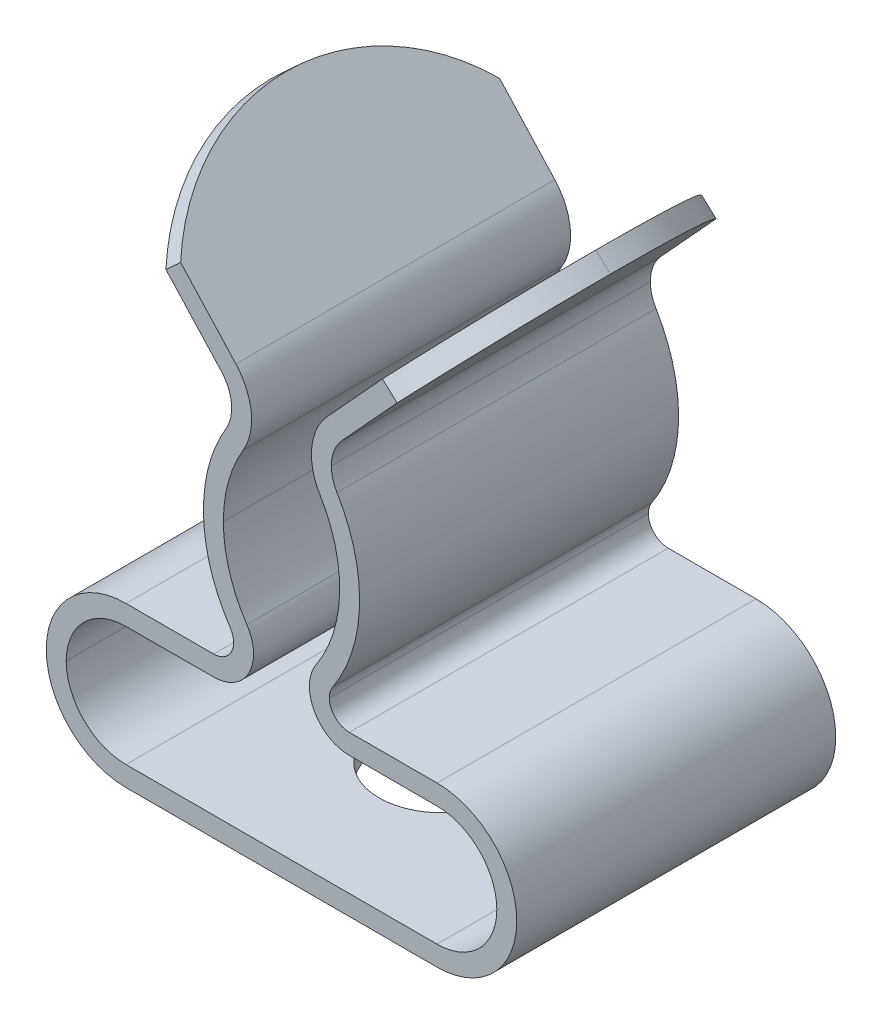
ISO-10303-21;
HEADER;
FILE_DESCRIPTION(('STEP AP214'),'2;1');
FILE_NAME('part.step','',(''),(''),'','','');
FILE_SCHEMA(('AUTOMOTIVE_DESIGN { 1 0 10303 214 1 1 1 1 }'));
ENDSEC;
DATA;
#1=APPLICATION_CONTEXT('core data for automotive mechanical design processes');
#2=APPLICATION_PROTOCOL_DEFINITION('international standard','automotive_design',2000,#1);
#3=PRODUCT_CONTEXT('',#1,'mechanical');
#4=PRODUCT('Part','Part','',(#3));
#5=PRODUCT_RELATED_PRODUCT_CATEGORY('part','',(#4));
#6=PRODUCT_DEFINITION_FORMATION('','',#4);
#7=PRODUCT_DEFINITION_CONTEXT('part definition',#1,'design');
#8=PRODUCT_DEFINITION('design','',#6,#7);
#9=PRODUCT_DEFINITION_SHAPE('','',#8);
#10=(LENGTH_UNIT() NAMED_UNIT(*) SI_UNIT(.MILLI.,.METRE.));
#11=(NAMED_UNIT(*) PLANE_ANGLE_UNIT() SI_UNIT($,.RADIAN.));
#12=(NAMED_UNIT(*) SI_UNIT($,.STERADIAN.) SOLID_ANGLE_UNIT());
#13=UNCERTAINTY_MEASURE_WITH_UNIT(LENGTH_MEASURE(1.E-05),#10,'distance_accuracy_value','');
#14=(GEOMETRIC_REPRESENTATION_CONTEXT(3) GLOBAL_UNCERTAINTY_ASSIGNED_CONTEXT((#13)) GLOBAL_UNIT_ASSIGNED_CONTEXT((#10,
#11,#12)) REPRESENTATION_CONTEXT('',''));
#15=CARTESIAN_POINT('',(0.,0.,0.));
#16=DIRECTION('',(0.,0.,1.));
#17=DIRECTION('',(1.,0.,0.));
#18=AXIS2_PLACEMENT_3D('',#15,#16,#17);
#19=CARTESIAN_POINT('',(0.,9.3,-13.5179054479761));
#20=DIRECTION('',(0.,-1.,0.));
#21=DIRECTION('',(0.,0.,-1.));
#22=AXIS2_PLACEMENT_3D('',#19,#20,#21);
#23=CYLINDRICAL_SURFACE('',#22,1.55);
#24=DIRECTION('',(0.,-1.,0.));
#25=VECTOR('',#24,1.);
#26=CARTESIAN_POINT('',(0.,9.3,-11.9679054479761));
#27=LINE('',#26,#25);
#28=CARTESIAN_POINT('',(0.,9.8,-11.9679054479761));
#29=VERTEX_POINT('',#28);
#30=CARTESIAN_POINT('',(0.,9.3,-11.9679054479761));
#31=VERTEX_POINT('',#30);
#32=EDGE_CURVE('E774',#29,#31,#27,.T.);
#33=ORIENTED_EDGE('',*,*,#32,.F.);
#34=CARTESIAN_POINT('',(0.,9.8,-13.5179054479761));
#35=DIRECTION('',(0.,1.,0.));
#36=DIRECTION('',(0.,0.,1.));
#37=AXIS2_PLACEMENT_3D('',#34,#35,#36);
#38=CIRCLE('',#37,1.55);
#39=CARTESIAN_POINT('',(0.,9.8,-15.0679054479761));
#40=VERTEX_POINT('',#39);
#41=EDGE_CURVE('E382',#29,#40,#38,.T.);
#42=ORIENTED_EDGE('',*,*,#41,.T.);
#43=DIRECTION('',(0.,-1.,0.));
#44=VECTOR('',#43,1.);
#45=CARTESIAN_POINT('',(0.,9.3,-15.0679054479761));
#46=LINE('',#45,#44);
#47=CARTESIAN_POINT('',(0.,9.3,-15.0679054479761));
#48=VERTEX_POINT('',#47);
#49=EDGE_CURVE('E791',#40,#48,#46,.T.);
#50=ORIENTED_EDGE('',*,*,#49,.T.);
#51=CARTESIAN_POINT('',(0.,9.3,-13.5179054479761));
#52=DIRECTION('',(0.,-1.,0.));
#53=DIRECTION('',(0.,0.,-1.));
#54=AXIS2_PLACEMENT_3D('',#51,#52,#53);
#55=CIRCLE('',#54,1.55);
#56=EDGE_CURVE('E19',#48,#31,#55,.T.);
#57=ORIENTED_EDGE('',*,*,#56,.T.);
#58=EDGE_LOOP('',(#33,#42,#50,#57));
#59=FACE_BOUND('',#58,.T.);
#60=ADVANCED_FACE('F16',(#59),#23,.F.);
#61=CARTESIAN_POINT('',(4.81352127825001,24.0517607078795,-13.5179054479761));
#62=DIRECTION('',(-0.737277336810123,-0.675590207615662,0.));
#63=DIRECTION('',(0.675590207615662,-0.737277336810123,0.));
#64=AXIS2_PLACEMENT_3D('',#61,#62,#63);
#65=CYLINDRICAL_SURFACE('',#64,5.);
#66=CARTESIAN_POINT('',(-0.503410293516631,19.1796905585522,-13.5179054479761));
#67=DIRECTION('',(-0.737277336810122,-0.675590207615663,0.));
#68=DIRECTION('',(-0.675590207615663,0.737277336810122,0.));
#69=AXIS2_PLACEMENT_3D('',#66,#67,#68);
#70=CIRCLE('',#69,5.);
#71=CARTESIAN_POINT('',(-2.53018091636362,21.3915225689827,-9.51790544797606));
#72=VERTEX_POINT('',#71);
#73=CARTESIAN_POINT('',(-2.53018091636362,21.3915225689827,-17.5179054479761));
#74=VERTEX_POINT('',#73);
#75=EDGE_CURVE('E526',#72,#74,#70,.T.);
#76=ORIENTED_EDGE('',*,*,#75,.T.);
#77=DIRECTION('',(-0.737277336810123,-0.675590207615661,0.));
#78=VECTOR('',#77,1.);
#79=CARTESIAN_POINT('',(2.78675065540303,26.2635927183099,-17.5179054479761));
#80=LINE('',#79,#78);
#81=CARTESIAN_POINT('',(-2.89881958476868,21.0537274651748,-17.5179054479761));
#82=VERTEX_POINT('',#81);
#83=EDGE_CURVE('E573',#74,#82,#80,.T.);
#84=ORIENTED_EDGE('',*,*,#83,.T.);
#85=CARTESIAN_POINT('',(-0.872048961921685,18.8418954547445,-13.5179054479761));
#86=DIRECTION('',(0.737277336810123,0.675590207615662,0.));
#87=DIRECTION('',(0.675590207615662,-0.737277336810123,0.));
#88=AXIS2_PLACEMENT_3D('',#85,#86,#87);
#89=CIRCLE('',#88,5.);
#90=CARTESIAN_POINT('',(-2.89881958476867,21.0537274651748,-9.51790544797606));
#91=VERTEX_POINT('',#90);
#92=EDGE_CURVE('E552',#82,#91,#89,.T.);
#93=ORIENTED_EDGE('',*,*,#92,.T.);
#94=DIRECTION('',(-0.737277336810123,-0.675590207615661,0.));
#95=VECTOR('',#94,1.);
#96=CARTESIAN_POINT('',(2.78675065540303,26.2635927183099,-9.51790544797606));
#97=LINE('',#96,#95);
#98=EDGE_CURVE('E570',#72,#91,#97,.T.);
#99=ORIENTED_EDGE('',*,*,#98,.F.);
#100=EDGE_LOOP('',(#76,#84,#93,#99));
#101=FACE_BOUND('',#100,.T.);
#102=ADVANCED_FACE('F765',(#101),#65,.T.);
#103=CARTESIAN_POINT('',(-4.81352127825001,24.0517607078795,-13.5179054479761));
#104=DIRECTION('',(0.737277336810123,-0.675590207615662,0.));
#105=DIRECTION('',(0.675590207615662,0.737277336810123,0.));
#106=AXIS2_PLACEMENT_3D('',#103,#104,#105);
#107=CYLINDRICAL_SURFACE('',#106,5.);
#108=DIRECTION('',(0.737277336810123,-0.675590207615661,0.));
#109=VECTOR('',#108,1.);
#110=CARTESIAN_POINT('',(-1.4355702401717,27.7381473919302,-13.5179054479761));
#111=LINE('',#110,#109);
#112=CARTESIAN_POINT('',(3.88136133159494,22.8660772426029,-13.5179054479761));
#113=VERTEX_POINT('',#112);
#114=CARTESIAN_POINT('',(4.25,22.5282821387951,-13.5179054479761));
#115=VERTEX_POINT('',#114);
#116=EDGE_CURVE('E660',#113,#115,#111,.T.);
#117=ORIENTED_EDGE('',*,*,#116,.F.);
#118=CARTESIAN_POINT('',(0.50341029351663,19.1796905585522,-13.5179054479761));
#119=DIRECTION('',(0.737277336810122,-0.675590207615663,0.));
#120=DIRECTION('',(-0.675590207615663,-0.737277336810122,0.));
#121=AXIS2_PLACEMENT_3D('',#118,#119,#120);
#122=CIRCLE('',#121,5.);
#123=CARTESIAN_POINT('',(2.53018091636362,21.3915225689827,-9.51790544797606));
#124=VERTEX_POINT('',#123);
#125=EDGE_CURVE('E565',#113,#124,#122,.T.);
#126=ORIENTED_EDGE('',*,*,#125,.T.);
#127=DIRECTION('',(0.737277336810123,-0.675590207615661,0.));
#128=VECTOR('',#127,1.);
#129=CARTESIAN_POINT('',(-2.78675065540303,26.2635927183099,-9.51790544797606));
#130=LINE('',#129,#128);
#131=CARTESIAN_POINT('',(2.89881958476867,21.0537274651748,-9.51790544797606));
#132=VERTEX_POINT('',#131);
#133=EDGE_CURVE('E462',#124,#132,#130,.T.);
#134=ORIENTED_EDGE('',*,*,#133,.T.);
#135=CARTESIAN_POINT('',(0.872048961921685,18.8418954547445,-13.5179054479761));
#136=DIRECTION('',(-0.737277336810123,0.675590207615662,0.));
#137=DIRECTION('',(-0.675590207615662,-0.737277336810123,0.));
#138=AXIS2_PLACEMENT_3D('',#135,#136,#137);
#139=CIRCLE('',#138,5.);
#140=EDGE_CURVE('E693',#132,#115,#139,.T.);
#141=ORIENTED_EDGE('',*,*,#140,.T.);
#142=EDGE_LOOP('',(#117,#126,#134,#141));
#143=FACE_BOUND('',#142,.T.);
#144=ADVANCED_FACE('F853',(#143),#107,.T.);
#145=CARTESIAN_POINT('',(2.25,18.8654779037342,-9.51790544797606));
#146=DIRECTION('',(0.,0.,-1.));
#147=DIRECTION('',(-1.,0.,0.));
#148=AXIS2_PLACEMENT_3D('',#145,#146,#147);
#149=CYLINDRICAL_SURFACE('',#148,1.);
#150=DIRECTION('',(0.,0.,-1.));
#151=VECTOR('',#150,1.);
#152=CARTESIAN_POINT('',(1.25,18.8654779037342,-9.51790544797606));
#153=LINE('',#152,#151);
#154=CARTESIAN_POINT('',(1.25,18.8654779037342,-9.51790544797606));
#155=VERTEX_POINT('',#154);
#156=CARTESIAN_POINT('',(1.25,18.8654779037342,-17.5179054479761));
#157=VERTEX_POINT('',#156);
#158=EDGE_CURVE('E687',#155,#157,#153,.T.);
#159=ORIENTED_EDGE('',*,*,#158,.F.);
#160=CARTESIAN_POINT('',(2.25,18.8654779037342,-9.51790544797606));
#161=DIRECTION('',(0.,0.,-1.));
#162=DIRECTION('',(-1.,0.,0.));
#163=AXIS2_PLACEMENT_3D('',#160,#161,#162);
#164=CIRCLE('',#163,1.);
#165=CARTESIAN_POINT('',(1.39166852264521,18.3523823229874,-9.51790544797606));
#166=VERTEX_POINT('',#165);
#167=EDGE_CURVE('E463',#166,#155,#164,.T.);
#168=ORIENTED_EDGE('',*,*,#167,.F.);
#169=DIRECTION('',(0.,0.,-1.));
#170=VECTOR('',#169,1.);
#171=CARTESIAN_POINT('',(1.39166852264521,18.3523823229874,-9.51790544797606));
#172=LINE('',#171,#170);
#173=CARTESIAN_POINT('',(1.39166852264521,18.3523823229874,-17.5179054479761));
#174=VERTEX_POINT('',#173);
#175=EDGE_CURVE('E11',#166,#174,#172,.T.);
#176=ORIENTED_EDGE('',*,*,#175,.T.);
#177=CARTESIAN_POINT('',(2.25,18.8654779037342,-17.5179054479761));
#178=DIRECTION('',(0.,0.,-1.));
#179=DIRECTION('',(-1.,0.,0.));
#180=AXIS2_PLACEMENT_3D('',#177,#178,#179);
#181=CIRCLE('',#180,1.);
#182=EDGE_CURVE('E532',#174,#157,#181,.T.);
#183=ORIENTED_EDGE('',*,*,#182,.T.);
#184=EDGE_LOOP('',(#159,#168,#176,#183));
#185=FACE_BOUND('',#184,.T.);
#186=ADVANCED_FACE('F838',(#185),#149,.F.);
#187=CARTESIAN_POINT('',(-2.04165738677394,16.3,-9.51790544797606));
#188=DIRECTION('',(0.,0.,-1.));
#189=DIRECTION('',(-1.,0.,0.));
#190=AXIS2_PLACEMENT_3D('',#187,#188,#189);
#191=CYLINDRICAL_SURFACE('',#190,4.);
#192=CARTESIAN_POINT('',(-2.04165738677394,16.3,-17.5179054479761));
#193=DIRECTION('',(0.,0.,1.));
#194=DIRECTION('',(1.,0.,0.));
#195=AXIS2_PLACEMENT_3D('',#192,#193,#194);
#196=CIRCLE('',#195,4.);
#197=CARTESIAN_POINT('',(1.28426029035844,14.0777777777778,-17.5179054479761));
#198=VERTEX_POINT('',#197);
#199=EDGE_CURVE('E535',#198,#174,#196,.T.);
#200=ORIENTED_EDGE('',*,*,#199,.T.);
#201=ORIENTED_EDGE('',*,*,#175,.F.);
#202=CARTESIAN_POINT('',(-2.04165738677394,16.3,-9.51790544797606));
#203=DIRECTION('',(0.,0.,1.));
#204=DIRECTION('',(1.,0.,0.));
#205=AXIS2_PLACEMENT_3D('',#202,#203,#204);
#206=CIRCLE('',#205,4.);
#207=CARTESIAN_POINT('',(1.28426029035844,14.0777777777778,-9.51790544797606));
#208=VERTEX_POINT('',#207);
#209=EDGE_CURVE('E446',#208,#166,#206,.T.);
#210=ORIENTED_EDGE('',*,*,#209,.F.);
#211=DIRECTION('',(0.,0.,-1.));
#212=VECTOR('',#211,1.);
#213=CARTESIAN_POINT('',(1.28426029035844,14.0777777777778,-9.51790544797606));
#214=LINE('',#213,#212);
#215=EDGE_CURVE('E703',#208,#198,#214,.T.);
#216=ORIENTED_EDGE('',*,*,#215,.T.);
#217=EDGE_LOOP('',(#200,#201,#210,#216));
#218=FACE_BOUND('',#217,.T.);
#219=ADVANCED_FACE('F830',(#218),#191,.T.);
#220=CARTESIAN_POINT('',(1.7,13.8,-9.51790544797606));
#221=DIRECTION('',(0.,0.,-1.));
#222=DIRECTION('',(-1.,0.,0.));
#223=AXIS2_PLACEMENT_3D('',#220,#221,#222);
#224=CYLINDRICAL_SURFACE('',#223,0.5);
#225=DIRECTION('',(0.,0.,-1.));
#226=VECTOR('',#225,1.);
#227=CARTESIAN_POINT('',(1.2,13.8,-9.51790544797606));
#228=LINE('',#227,#226);
#229=CARTESIAN_POINT('',(1.2,13.8,-9.51790544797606));
#230=VERTEX_POINT('',#229);
#231=CARTESIAN_POINT('',(1.2,13.8,-17.5179054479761));
#232=VERTEX_POINT('',#231);
#233=EDGE_CURVE('E662',#230,#232,#228,.T.);
#234=ORIENTED_EDGE('',*,*,#233,.F.);
#235=CARTESIAN_POINT('',(1.7,13.8,-9.51790544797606));
#236=DIRECTION('',(0.,0.,-1.));
#237=DIRECTION('',(-1.,0.,0.));
#238=AXIS2_PLACEMENT_3D('',#235,#236,#237);
#239=CIRCLE('',#238,0.5);
#240=CARTESIAN_POINT('',(1.7,13.3,-9.51790544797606));
#241=VERTEX_POINT('',#240);
#242=EDGE_CURVE('E439',#241,#230,#239,.T.);
#243=ORIENTED_EDGE('',*,*,#242,.F.);
#244=DIRECTION('',(0.,0.,-1.));
#245=VECTOR('',#244,1.);
#246=CARTESIAN_POINT('',(1.7,13.3,-9.51790544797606));
#247=LINE('',#246,#245);
#248=CARTESIAN_POINT('',(1.7,13.3,-17.5179054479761));
#249=VERTEX_POINT('',#248);
#250=EDGE_CURVE('E26',#241,#249,#247,.T.);
#251=ORIENTED_EDGE('',*,*,#250,.T.);
#252=CARTESIAN_POINT('',(1.7,13.8,-17.5179054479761));
#253=DIRECTION('',(0.,0.,-1.));
#254=DIRECTION('',(-1.,0.,0.));
#255=AXIS2_PLACEMENT_3D('',#252,#253,#254);
#256=CIRCLE('',#255,0.5);
#257=EDGE_CURVE('E544',#249,#232,#256,.T.);
#258=ORIENTED_EDGE('',*,*,#257,.T.);
#259=EDGE_LOOP('',(#234,#243,#251,#258));
#260=FACE_BOUND('',#259,.T.);
#261=ADVANCED_FACE('F824',(#260),#224,.F.);
#262=CARTESIAN_POINT('',(3.9,13.3,-9.51790544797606));
#263=DIRECTION('',(0.,-1.,0.));
#264=DIRECTION('',(0.,0.,-1.));
#265=AXIS2_PLACEMENT_3D('',#262,#263,#264);
#266=PLANE('',#265);
#267=DIRECTION('',(-1.,0.,0.));
#268=VECTOR('',#267,1.);
#269=CARTESIAN_POINT('',(3.9,13.3,-17.5179054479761));
#270=LINE('',#269,#268);
#271=CARTESIAN_POINT('',(3.9,13.3,-17.5179054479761));
#272=VERTEX_POINT('',#271);
#273=EDGE_CURVE('E453',#272,#249,#270,.T.);
#274=ORIENTED_EDGE('',*,*,#273,.T.);
#275=ORIENTED_EDGE('',*,*,#250,.F.);
#276=DIRECTION('',(-1.,0.,0.));
#277=VECTOR('',#276,1.);
#278=CARTESIAN_POINT('',(3.9,13.3,-9.51790544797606));
#279=LINE('',#278,#277);
#280=CARTESIAN_POINT('',(3.9,13.3,-9.51790544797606));
#281=VERTEX_POINT('',#280);
#282=EDGE_CURVE('E430',#281,#241,#279,.T.);
#283=ORIENTED_EDGE('',*,*,#282,.F.);
#284=DIRECTION('',(0.,0.,-1.));
#285=VECTOR('',#284,1.);
#286=CARTESIAN_POINT('',(3.9,13.3,-9.51790544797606));
#287=LINE('',#286,#285);
#288=EDGE_CURVE('E397',#281,#272,#287,.T.);
#289=ORIENTED_EDGE('',*,*,#288,.T.);
#290=EDGE_LOOP('',(#274,#275,#283,#289));
#291=FACE_BOUND('',#290,.T.);
#292=ADVANCED_FACE('F822',(#291),#266,.F.);
#293=CARTESIAN_POINT('',(3.9,11.3,-9.51790544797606));
#294=DIRECTION('',(0.,0.,-1.));
#295=DIRECTION('',(-1.,0.,0.));
#296=AXIS2_PLACEMENT_3D('',#293,#294,#295);
#297=CYLINDRICAL_SURFACE('',#296,2.);
#298=CARTESIAN_POINT('',(3.9,11.3,-17.5179054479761));
#299=DIRECTION('',(0.,0.,1.));
#300=DIRECTION('',(1.,0.,0.));
#301=AXIS2_PLACEMENT_3D('',#298,#299,#300);
#302=CIRCLE('',#301,2.);
#303=CARTESIAN_POINT('',(3.9,9.3,-17.5179054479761));
#304=VERTEX_POINT('',#303);
#305=EDGE_CURVE('E366',#304,#272,#302,.T.);
#306=ORIENTED_EDGE('',*,*,#305,.T.);
#307=ORIENTED_EDGE('',*,*,#288,.F.);
#308=CARTESIAN_POINT('',(3.9,11.3,-9.51790544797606));
#309=DIRECTION('',(0.,0.,1.));
#310=DIRECTION('',(1.,0.,0.));
#311=AXIS2_PLACEMENT_3D('',#308,#309,#310);
#312=CIRCLE('',#311,2.);
#313=CARTESIAN_POINT('',(3.9,9.3,-9.51790544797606));
#314=VERTEX_POINT('',#313);
#315=EDGE_CURVE('E426',#314,#281,#312,.T.);
#316=ORIENTED_EDGE('',*,*,#315,.F.);
#317=DIRECTION('',(0.,0.,-1.));
#318=VECTOR('',#317,1.);
#319=CARTESIAN_POINT('',(3.9,9.3,-9.51790544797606));
#320=LINE('',#319,#318);
#321=EDGE_CURVE('E343',#314,#304,#320,.T.);
#322=ORIENTED_EDGE('',*,*,#321,.T.);
#323=EDGE_LOOP('',(#306,#307,#316,#322));
#324=FACE_BOUND('',#323,.T.);
#325=ADVANCED_FACE('F821',(#324),#297,.T.);
#326=CARTESIAN_POINT('',(3.9,9.3,-9.51790544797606));
#327=DIRECTION('',(0.,1.,0.));
#328=DIRECTION('',(0.,0.,-1.));
#329=AXIS2_PLACEMENT_3D('',#326,#327,#328);
#330=PLANE('',#329);
#331=ORIENTED_EDGE('',*,*,#56,.F.);
#332=CARTESIAN_POINT('',(0.,9.3,-13.5179054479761));
#333=DIRECTION('',(0.,-1.,0.));
#334=DIRECTION('',(0.,0.,-1.));
#335=AXIS2_PLACEMENT_3D('',#332,#333,#334);
#336=CIRCLE('',#335,1.55);
#337=EDGE_CURVE('E777',#31,#48,#336,.T.);
#338=ORIENTED_EDGE('',*,*,#337,.F.);
#339=EDGE_LOOP('',(#331,#338));
#340=FACE_BOUND('',#339,.T.);
#341=DIRECTION('',(1.,0.,0.));
#342=VECTOR('',#341,1.);
#343=CARTESIAN_POINT('',(3.9,9.3,-17.5179054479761));
#344=LINE('',#343,#342);
#345=CARTESIAN_POINT('',(-3.9,9.3,-17.5179054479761));
#346=VERTEX_POINT('',#345);
#347=EDGE_CURVE('E360',#346,#304,#344,.T.);
#348=ORIENTED_EDGE('',*,*,#347,.T.);
#349=ORIENTED_EDGE('',*,*,#321,.F.);
#350=DIRECTION('',(1.,0.,0.));
#351=VECTOR('',#350,1.);
#352=CARTESIAN_POINT('',(3.9,9.3,-9.51790544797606));
#353=LINE('',#352,#351);
#354=CARTESIAN_POINT('',(-3.9,9.3,-9.51790544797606));
#355=VERTEX_POINT('',#354);
#356=EDGE_CURVE('E431',#355,#314,#353,.T.);
#357=ORIENTED_EDGE('',*,*,#356,.F.);
#358=DIRECTION('',(0.,0.,-1.));
#359=VECTOR('',#358,1.);
#360=CARTESIAN_POINT('',(-3.9,9.3,-9.51790544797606));
#361=LINE('',#360,#359);
#362=EDGE_CURVE('E719',#355,#346,#361,.T.);
#363=ORIENTED_EDGE('',*,*,#362,.T.);
#364=EDGE_LOOP('',(#348,#349,#357,#363));
#365=FACE_BOUND('',#364,.T.);
#366=ADVANCED_FACE('F819',(#340,#365),#330,.F.);
#367=CARTESIAN_POINT('',(-3.9,11.3,-9.51790544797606));
#368=DIRECTION('',(0.,0.,-1.));
#369=DIRECTION('',(-1.,0.,0.));
#370=AXIS2_PLACEMENT_3D('',#367,#368,#369);
#371=CYLINDRICAL_SURFACE('',#370,2.);
#372=DIRECTION('',(0.,0.,-1.));
#373=VECTOR('',#372,1.);
#374=CARTESIAN_POINT('',(-5.9,11.3,-9.51790544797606));
#375=LINE('',#374,#373);
#376=CARTESIAN_POINT('',(-5.9,11.3,-9.51790544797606));
#377=VERTEX_POINT('',#376);
#378=CARTESIAN_POINT('',(-5.9,11.3,-17.5179054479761));
#379=VERTEX_POINT('',#378);
#380=EDGE_CURVE('E714',#377,#379,#375,.T.);
#381=ORIENTED_EDGE('',*,*,#380,.F.);
#382=CARTESIAN_POINT('',(-3.9,11.3,-9.51790544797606));
#383=DIRECTION('',(0.,0.,1.));
#384=DIRECTION('',(-1.,0.,0.));
#385=AXIS2_PLACEMENT_3D('',#382,#383,#384);
#386=CIRCLE('',#385,2.);
#387=CARTESIAN_POINT('',(-3.9,13.3,-9.51790544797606));
#388=VERTEX_POINT('',#387);
#389=EDGE_CURVE('E338',#388,#377,#386,.T.);
#390=ORIENTED_EDGE('',*,*,#389,.F.);
#391=DIRECTION('',(0.,0.,-1.));
#392=VECTOR('',#391,1.);
#393=CARTESIAN_POINT('',(-3.9,13.3,-9.51790544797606));
#394=LINE('',#393,#392);
#395=CARTESIAN_POINT('',(-3.9,13.3,-17.5179054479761));
#396=VERTEX_POINT('',#395);
#397=EDGE_CURVE('E331',#388,#396,#394,.T.);
#398=ORIENTED_EDGE('',*,*,#397,.T.);
#399=CARTESIAN_POINT('',(-3.9,11.3,-17.5179054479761));
#400=DIRECTION('',(0.,0.,1.));
#401=DIRECTION('',(-1.,0.,0.));
#402=AXIS2_PLACEMENT_3D('',#399,#400,#401);
#403=CIRCLE('',#402,2.);
#404=EDGE_CURVE('E336',#396,#379,#403,.T.);
#405=ORIENTED_EDGE('',*,*,#404,.T.);
#406=EDGE_LOOP('',(#381,#390,#398,#405));
#407=FACE_BOUND('',#406,.T.);
#408=ADVANCED_FACE('F334',(#407),#371,.T.);
#409=CARTESIAN_POINT('',(-3.9,13.3,-9.51790544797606));
#410=DIRECTION('',(0.,-1.,0.));
#411=DIRECTION('',(-1.,0.,0.));
#412=AXIS2_PLACEMENT_3D('',#409,#410,#411);
#413=PLANE('',#412);
#414=DIRECTION('',(-1.,0.,0.));
#415=VECTOR('',#414,1.);
#416=CARTESIAN_POINT('',(-3.9,13.3,-17.5179054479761));
#417=LINE('',#416,#415);
#418=CARTESIAN_POINT('',(-1.7,13.3,-17.5179054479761));
#419=VERTEX_POINT('',#418);
#420=EDGE_CURVE('E347',#419,#396,#417,.T.);
#421=ORIENTED_EDGE('',*,*,#420,.T.);
#422=ORIENTED_EDGE('',*,*,#397,.F.);
#423=DIRECTION('',(-1.,0.,0.));
#424=VECTOR('',#423,1.);
#425=CARTESIAN_POINT('',(-3.9,13.3,-9.51790544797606));
#426=LINE('',#425,#424);
#427=CARTESIAN_POINT('',(-1.7,13.3,-9.51790544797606));
#428=VERTEX_POINT('',#427);
#429=EDGE_CURVE('E582',#428,#388,#426,.T.);
#430=ORIENTED_EDGE('',*,*,#429,.F.);
#431=DIRECTION('',(0.,0.,-1.));
#432=VECTOR('',#431,1.);
#433=CARTESIAN_POINT('',(-1.7,13.3,-9.51790544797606));
#434=LINE('',#433,#432);
#435=EDGE_CURVE('E344',#428,#419,#434,.T.);
#436=ORIENTED_EDGE('',*,*,#435,.T.);
#437=EDGE_LOOP('',(#421,#422,#430,#436));
#438=FACE_BOUND('',#437,.T.);
#439=ADVANCED_FACE('F348',(#438),#413,.F.);
#440=CARTESIAN_POINT('',(-1.7,13.8,-9.51790544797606));
#441=DIRECTION('',(0.,0.,-1.));
#442=DIRECTION('',(-1.,0.,0.));
#443=AXIS2_PLACEMENT_3D('',#440,#441,#442);
#444=CYLINDRICAL_SURFACE('',#443,0.5);
#445=CARTESIAN_POINT('',(-1.7,13.8,-17.5179054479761));
#446=DIRECTION('',(0.,0.,-1.));
#447=DIRECTION('',(1.,0.,0.));
#448=AXIS2_PLACEMENT_3D('',#445,#446,#447);
#449=CIRCLE('',#448,0.5);
#450=CARTESIAN_POINT('',(-1.28426029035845,14.0777777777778,-17.5179054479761));
#451=VERTEX_POINT('',#450);
#452=EDGE_CURVE('E352',#451,#419,#449,.T.);
#453=ORIENTED_EDGE('',*,*,#452,.T.);
#454=ORIENTED_EDGE('',*,*,#435,.F.);
#455=CARTESIAN_POINT('',(-1.7,13.8,-9.51790544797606));
#456=DIRECTION('',(0.,0.,-1.));
#457=DIRECTION('',(1.,0.,0.));
#458=AXIS2_PLACEMENT_3D('',#455,#456,#457);
#459=CIRCLE('',#458,0.5);
#460=CARTESIAN_POINT('',(-1.28426029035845,14.0777777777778,-9.51790544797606));
#461=VERTEX_POINT('',#460);
#462=EDGE_CURVE('E585',#461,#428,#459,.T.);
#463=ORIENTED_EDGE('',*,*,#462,.F.);
#464=DIRECTION('',(0.,0.,-1.));
#465=VECTOR('',#464,1.);
#466=CARTESIAN_POINT('',(-1.28426029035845,14.0777777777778,-9.51790544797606));
#467=LINE('',#466,#465);
#468=EDGE_CURVE('E418',#461,#451,#467,.T.);
#469=ORIENTED_EDGE('',*,*,#468,.T.);
#470=EDGE_LOOP('',(#453,#454,#463,#469));
#471=FACE_BOUND('',#470,.T.);
#472=ADVANCED_FACE('F735',(#471),#444,.F.);
#473=CARTESIAN_POINT('',(2.04165738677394,16.3,-9.51790544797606));
#474=DIRECTION('',(0.,0.,-1.));
#475=DIRECTION('',(-1.,0.,0.));
#476=AXIS2_PLACEMENT_3D('',#473,#474,#475);
#477=CYLINDRICAL_SURFACE('',#476,4.);
#478=DIRECTION('',(0.,0.,-1.));
#479=VECTOR('',#478,1.);
#480=CARTESIAN_POINT('',(-1.95834261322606,16.3,-9.51790544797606));
#481=LINE('',#480,#479);
#482=CARTESIAN_POINT('',(-1.95834261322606,16.3,-9.51790544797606));
#483=VERTEX_POINT('',#482);
#484=CARTESIAN_POINT('',(-1.95834261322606,16.3,-17.5179054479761));
#485=VERTEX_POINT('',#484);
#486=EDGE_CURVE('E727',#483,#485,#481,.T.);
#487=ORIENTED_EDGE('',*,*,#486,.F.);
#488=CARTESIAN_POINT('',(2.04165738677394,16.3,-9.51790544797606));
#489=DIRECTION('',(0.,0.,1.));
#490=DIRECTION('',(-1.,0.,0.));
#491=AXIS2_PLACEMENT_3D('',#488,#489,#490);
#492=CIRCLE('',#491,4.);
#493=CARTESIAN_POINT('',(-1.39166852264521,18.3523823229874,-9.51790544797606));
#494=VERTEX_POINT('',#493);
#495=EDGE_CURVE('E580',#494,#483,#492,.T.);
#496=ORIENTED_EDGE('',*,*,#495,.F.);
#497=DIRECTION('',(0.,0.,-1.));
#498=VECTOR('',#497,1.);
#499=CARTESIAN_POINT('',(-1.39166852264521,18.3523823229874,-9.51790544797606));
#500=LINE('',#499,#498);
#501=CARTESIAN_POINT('',(-1.39166852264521,18.3523823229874,-17.5179054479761));
#502=VERTEX_POINT('',#501);
#503=EDGE_CURVE('E39',#494,#502,#500,.T.);
#504=ORIENTED_EDGE('',*,*,#503,.T.);
#505=CARTESIAN_POINT('',(2.04165738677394,16.3,-17.5179054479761));
#506=DIRECTION('',(0.,0.,1.));
#507=DIRECTION('',(-1.,0.,0.));
#508=AXIS2_PLACEMENT_3D('',#505,#506,#507);
#509=CIRCLE('',#508,4.);
#510=EDGE_CURVE('E370',#502,#485,#509,.T.);
#511=ORIENTED_EDGE('',*,*,#510,.T.);
#512=EDGE_LOOP('',(#487,#496,#504,#511));
#513=FACE_BOUND('',#512,.T.);
#514=ADVANCED_FACE('F744',(#513),#477,.T.);
#515=CARTESIAN_POINT('',(-2.25,18.8654779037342,-9.51790544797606));
#516=DIRECTION('',(0.,0.,-1.));
#517=DIRECTION('',(-1.,0.,0.));
#518=AXIS2_PLACEMENT_3D('',#515,#516,#517);
#519=CYLINDRICAL_SURFACE('',#518,1.);
#520=CARTESIAN_POINT('',(-2.25,18.8654779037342,-17.5179054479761));
#521=DIRECTION('',(0.,0.,-1.));
#522=DIRECTION('',(1.,0.,0.));
#523=AXIS2_PLACEMENT_3D('',#520,#521,#522);
#524=CIRCLE('',#523,1.);
#525=CARTESIAN_POINT('',(-1.51272266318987,19.5410681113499,-17.5179054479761));
#526=VERTEX_POINT('',#525);
#527=EDGE_CURVE('E372',#526,#502,#524,.T.);
#528=ORIENTED_EDGE('',*,*,#527,.T.);
#529=ORIENTED_EDGE('',*,*,#503,.F.);
#530=CARTESIAN_POINT('',(-2.25,18.8654779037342,-9.51790544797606));
#531=DIRECTION('',(0.,0.,-1.));
#532=DIRECTION('',(1.,0.,0.));
#533=AXIS2_PLACEMENT_3D('',#530,#531,#532);
#534=CIRCLE('',#533,1.);
#535=CARTESIAN_POINT('',(-1.51272266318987,19.5410681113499,-9.51790544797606));
#536=VERTEX_POINT('',#535);
#537=EDGE_CURVE('E577',#536,#494,#534,.T.);
#538=ORIENTED_EDGE('',*,*,#537,.F.);
#539=DIRECTION('',(0.,0.,-1.));
#540=VECTOR('',#539,1.);
#541=CARTESIAN_POINT('',(-1.51272266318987,19.5410681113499,-9.51790544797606));
#542=LINE('',#541,#540);
#543=EDGE_CURVE('E560',#536,#526,#542,.T.);
#544=ORIENTED_EDGE('',*,*,#543,.T.);
#545=EDGE_LOOP('',(#528,#529,#538,#544));
#546=FACE_BOUND('',#545,.T.);
#547=ADVANCED_FACE('F751',(#546),#519,.F.);
#548=CARTESIAN_POINT('',(-2.25,18.8654779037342,-9.51790544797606));
#549=DIRECTION('',(0.,0.,-1.));
#550=DIRECTION('',(-1.,0.,0.));
#551=AXIS2_PLACEMENT_3D('',#548,#549,#550);
#552=CYLINDRICAL_SURFACE('',#551,1.5);
#553=CARTESIAN_POINT('',(-2.25,18.8654779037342,-17.5179054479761));
#554=DIRECTION('',(0.,0.,-1.));
#555=DIRECTION('',(1.,0.,0.));
#556=AXIS2_PLACEMENT_3D('',#553,#554,#555);
#557=CIRCLE('',#556,1.5);
#558=CARTESIAN_POINT('',(-1.14408399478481,19.8788632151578,-17.5179054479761));
#559=VERTEX_POINT('',#558);
#560=CARTESIAN_POINT('',(-0.962502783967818,18.095834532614,-17.5179054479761));
#561=VERTEX_POINT('',#560);
#562=EDGE_CURVE('E576',#559,#561,#557,.T.);
#563=ORIENTED_EDGE('',*,*,#562,.F.);
#564=DIRECTION('',(0.,0.,-1.));
#565=VECTOR('',#564,1.);
#566=CARTESIAN_POINT('',(-1.14408399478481,19.8788632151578,-9.51790544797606));
#567=LINE('',#566,#565);
#568=CARTESIAN_POINT('',(-1.14408399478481,19.8788632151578,-9.51790544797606));
#569=VERTEX_POINT('',#568);
#570=EDGE_CURVE('E531',#569,#559,#567,.T.);
#571=ORIENTED_EDGE('',*,*,#570,.F.);
#572=CARTESIAN_POINT('',(-2.25,18.8654779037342,-9.51790544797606));
#573=DIRECTION('',(0.,0.,-1.));
#574=DIRECTION('',(1.,0.,0.));
#575=AXIS2_PLACEMENT_3D('',#572,#573,#574);
#576=CIRCLE('',#575,1.5);
#577=CARTESIAN_POINT('',(-0.962502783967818,18.095834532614,-9.51790544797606));
#578=VERTEX_POINT('',#577);
#579=EDGE_CURVE('E620',#569,#578,#576,.T.);
#580=ORIENTED_EDGE('',*,*,#579,.T.);
#581=DIRECTION('',(0.,0.,-1.));
#582=VECTOR('',#581,1.);
#583=CARTESIAN_POINT('',(-0.962502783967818,18.095834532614,-9.51790544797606));
#584=LINE('',#583,#582);
#585=EDGE_CURVE('E443',#578,#561,#584,.T.);
#586=ORIENTED_EDGE('',*,*,#585,.T.);
#587=EDGE_LOOP('',(#563,#571,#580,#586));
#588=FACE_BOUND('',#587,.T.);
#589=ADVANCED_FACE('F916',(#588),#552,.T.);
#590=CARTESIAN_POINT('',(2.04165738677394,16.3,-9.51790544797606));
#591=DIRECTION('',(0.,0.,-1.));
#592=DIRECTION('',(-1.,0.,0.));
#593=AXIS2_PLACEMENT_3D('',#590,#591,#592);
#594=CYLINDRICAL_SURFACE('',#593,3.5);
#595=DIRECTION('',(0.,0.,-1.));
#596=VECTOR('',#595,1.);
#597=CARTESIAN_POINT('',(-1.45834261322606,16.3,-9.51790544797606));
#598=LINE('',#597,#596);
#599=CARTESIAN_POINT('',(-1.45834261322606,16.3,-9.51790544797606));
#600=VERTEX_POINT('',#599);
#601=CARTESIAN_POINT('',(-1.45834261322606,16.3,-17.5179054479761));
#602=VERTEX_POINT('',#601);
#603=EDGE_CURVE('E425',#600,#602,#598,.T.);
#604=ORIENTED_EDGE('',*,*,#603,.F.);
#605=CARTESIAN_POINT('',(2.04165738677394,16.3,-9.51790544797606));
#606=DIRECTION('',(0.,0.,1.));
#607=DIRECTION('',(1.,0.,0.));
#608=AXIS2_PLACEMENT_3D('',#605,#606,#607);
#609=CIRCLE('',#608,3.5);
#610=CARTESIAN_POINT('',(-0.868520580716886,14.3555555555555,-9.51790544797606));
#611=VERTEX_POINT('',#610);
#612=EDGE_CURVE('E616',#600,#611,#609,.T.);
#613=ORIENTED_EDGE('',*,*,#612,.T.);
#614=DIRECTION('',(0.,0.,-1.));
#615=VECTOR('',#614,1.);
#616=CARTESIAN_POINT('',(-0.868520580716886,14.3555555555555,-9.51790544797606));
#617=LINE('',#616,#615);
#618=CARTESIAN_POINT('',(-0.868520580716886,14.3555555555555,-17.5179054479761));
#619=VERTEX_POINT('',#618);
#620=EDGE_CURVE('E387',#611,#619,#617,.T.);
#621=ORIENTED_EDGE('',*,*,#620,.T.);
#622=CARTESIAN_POINT('',(2.04165738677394,16.3,-17.5179054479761));
#623=DIRECTION('',(0.,0.,1.));
#624=DIRECTION('',(1.,0.,0.));
#625=AXIS2_PLACEMENT_3D('',#622,#623,#624);
#626=CIRCLE('',#625,3.5);
#627=EDGE_CURVE('E500',#602,#619,#626,.T.);
#628=ORIENTED_EDGE('',*,*,#627,.F.);
#629=EDGE_LOOP('',(#604,#613,#621,#628));
#630=FACE_BOUND('',#629,.T.);
#631=ADVANCED_FACE('F910',(#630),#594,.F.);
#632=CARTESIAN_POINT('',(-1.7,13.8,-9.51790544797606));
#633=DIRECTION('',(0.,0.,-1.));
#634=DIRECTION('',(-1.,0.,0.));
#635=AXIS2_PLACEMENT_3D('',#632,#633,#634);
#636=CYLINDRICAL_SURFACE('',#635,1.);
#637=CARTESIAN_POINT('',(-1.7,13.8,-17.5179054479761));
#638=DIRECTION('',(0.,0.,-1.));
#639=DIRECTION('',(1.,0.,0.));
#640=AXIS2_PLACEMENT_3D('',#637,#638,#639);
#641=CIRCLE('',#640,1.);
#642=CARTESIAN_POINT('',(-1.7,12.8,-17.5179054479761));
#643=VERTEX_POINT('',#642);
#644=EDGE_CURVE('E495',#619,#643,#641,.T.);
#645=ORIENTED_EDGE('',*,*,#644,.F.);
#646=ORIENTED_EDGE('',*,*,#620,.F.);
#647=CARTESIAN_POINT('',(-1.7,13.8,-9.51790544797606));
#648=DIRECTION('',(0.,0.,-1.));
#649=DIRECTION('',(1.,0.,0.));
#650=AXIS2_PLACEMENT_3D('',#647,#648,#649);
#651=CIRCLE('',#650,1.);
#652=CARTESIAN_POINT('',(-1.7,12.8,-9.51790544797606));
#653=VERTEX_POINT('',#652);
#654=EDGE_CURVE('E612',#611,#653,#651,.T.);
#655=ORIENTED_EDGE('',*,*,#654,.T.);
#656=DIRECTION('',(0.,0.,-1.));
#657=VECTOR('',#656,1.);
#658=CARTESIAN_POINT('',(-1.7,12.8,-9.51790544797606));
#659=LINE('',#658,#657);
#660=EDGE_CURVE('E384',#653,#643,#659,.T.);
#661=ORIENTED_EDGE('',*,*,#660,.T.);
#662=EDGE_LOOP('',(#645,#646,#655,#661));
#663=FACE_BOUND('',#662,.T.);
#664=ADVANCED_FACE('F908',(#663),#636,.T.);
#665=CARTESIAN_POINT('',(-3.9,12.8,-9.51790544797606));
#666=DIRECTION('',(0.,-1.,0.));
#667=DIRECTION('',(-1.,0.,0.));
#668=AXIS2_PLACEMENT_3D('',#665,#666,#667);
#669=PLANE('',#668);
#670=DIRECTION('',(-1.,0.,0.));
#671=VECTOR('',#670,1.);
#672=CARTESIAN_POINT('',(-3.9,12.8,-17.5179054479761));
#673=LINE('',#672,#671);
#674=CARTESIAN_POINT('',(-3.9,12.8,-17.5179054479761));
#675=VERTEX_POINT('',#674);
#676=EDGE_CURVE('E499',#643,#675,#673,.T.);
#677=ORIENTED_EDGE('',*,*,#676,.F.);
#678=ORIENTED_EDGE('',*,*,#660,.F.);
#679=DIRECTION('',(-1.,0.,0.));
#680=VECTOR('',#679,1.);
#681=CARTESIAN_POINT('',(-3.9,12.8,-9.51790544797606));
#682=LINE('',#681,#680);
#683=CARTESIAN_POINT('',(-3.9,12.8,-9.51790544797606));
#684=VERTEX_POINT('',#683);
#685=EDGE_CURVE('E609',#653,#684,#682,.T.);
#686=ORIENTED_EDGE('',*,*,#685,.T.);
#687=DIRECTION('',(0.,0.,-1.));
#688=VECTOR('',#687,1.);
#689=CARTESIAN_POINT('',(-3.9,12.8,-9.51790544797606));
#690=LINE('',#689,#688);
#691=EDGE_CURVE('E473',#684,#675,#690,.T.);
#692=ORIENTED_EDGE('',*,*,#691,.T.);
#693=EDGE_LOOP('',(#677,#678,#686,#692));
#694=FACE_BOUND('',#693,.T.);
#695=ADVANCED_FACE('F902',(#694),#669,.T.);
#696=CARTESIAN_POINT('',(-3.9,11.3,-9.51790544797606));
#697=DIRECTION('',(0.,0.,-1.));
#698=DIRECTION('',(-1.,0.,0.));
#699=AXIS2_PLACEMENT_3D('',#696,#697,#698);
#700=CYLINDRICAL_SURFACE('',#699,1.5);
#701=DIRECTION('',(0.,0.,-1.));
#702=VECTOR('',#701,1.);
#703=CARTESIAN_POINT('',(-5.4,11.3,-9.51790544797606));
#704=LINE('',#703,#702);
#705=CARTESIAN_POINT('',(-5.4,11.3,-9.51790544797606));
#706=VERTEX_POINT('',#705);
#707=CARTESIAN_POINT('',(-5.4,11.3,-17.5179054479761));
#708=VERTEX_POINT('',#707);
#709=EDGE_CURVE('E457',#706,#708,#704,.T.);
#710=ORIENTED_EDGE('',*,*,#709,.F.);
#711=CARTESIAN_POINT('',(-3.9,11.3,-9.51790544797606));
#712=DIRECTION('',(0.,0.,1.));
#713=DIRECTION('',(1.,0.,0.));
#714=AXIS2_PLACEMENT_3D('',#711,#712,#713);
#715=CIRCLE('',#714,1.5);
#716=CARTESIAN_POINT('',(-3.9,9.8,-9.51790544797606));
#717=VERTEX_POINT('',#716);
#718=EDGE_CURVE('E605',#706,#717,#715,.T.);
#719=ORIENTED_EDGE('',*,*,#718,.T.);
#720=DIRECTION('',(0.,0.,-1.));
#721=VECTOR('',#720,1.);
#722=CARTESIAN_POINT('',(-3.9,9.8,-9.51790544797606));
#723=LINE('',#722,#721);
#724=CARTESIAN_POINT('',(-3.9,9.8,-17.5179054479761));
#725=VERTEX_POINT('',#724);
#726=EDGE_CURVE('E379',#717,#725,#723,.T.);
#727=ORIENTED_EDGE('',*,*,#726,.T.);
#728=CARTESIAN_POINT('',(-3.9,11.3,-17.5179054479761));
#729=DIRECTION('',(0.,0.,1.));
#730=DIRECTION('',(1.,0.,0.));
#731=AXIS2_PLACEMENT_3D('',#728,#729,#730);
#732=CIRCLE('',#731,1.5);
#733=EDGE_CURVE('E601',#708,#725,#732,.T.);
#734=ORIENTED_EDGE('',*,*,#733,.F.);
#735=EDGE_LOOP('',(#710,#719,#727,#734));
#736=FACE_BOUND('',#735,.T.);
#737=ADVANCED_FACE('F895',(#736),#700,.F.);
#738=CARTESIAN_POINT('',(3.9,9.8,-9.51790544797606));
#739=DIRECTION('',(0.,1.,0.));
#740=DIRECTION('',(0.,0.,-1.));
#741=AXIS2_PLACEMENT_3D('',#738,#739,#740);
#742=PLANE('',#741);
#743=CARTESIAN_POINT('',(0.,9.8,-13.5179054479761));
#744=DIRECTION('',(0.,1.,0.));
#745=DIRECTION('',(0.,0.,1.));
#746=AXIS2_PLACEMENT_3D('',#743,#744,#745);
#747=CIRCLE('',#746,1.55);
#748=EDGE_CURVE('E773',#40,#29,#747,.T.);
#749=ORIENTED_EDGE('',*,*,#748,.F.);
#750=ORIENTED_EDGE('',*,*,#41,.F.);
#751=EDGE_LOOP('',(#749,#750));
#752=FACE_BOUND('',#751,.T.);
#753=DIRECTION('',(1.,0.,0.));
#754=VECTOR('',#753,1.);
#755=CARTESIAN_POINT('',(3.9,9.8,-17.5179054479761));
#756=LINE('',#755,#754);
#757=CARTESIAN_POINT('',(3.9,9.8,-17.5179054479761));
#758=VERTEX_POINT('',#757);
#759=EDGE_CURVE('E629',#725,#758,#756,.T.);
#760=ORIENTED_EDGE('',*,*,#759,.F.);
#761=ORIENTED_EDGE('',*,*,#726,.F.);
#762=DIRECTION('',(1.,0.,0.));
#763=VECTOR('',#762,1.);
#764=CARTESIAN_POINT('',(3.9,9.8,-9.51790544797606));
#765=LINE('',#764,#763);
#766=CARTESIAN_POINT('',(3.9,9.8,-9.51790544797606));
#767=VERTEX_POINT('',#766);
#768=EDGE_CURVE('E504',#717,#767,#765,.T.);
#769=ORIENTED_EDGE('',*,*,#768,.T.);
#770=DIRECTION('',(0.,0.,-1.));
#771=VECTOR('',#770,1.);
#772=CARTESIAN_POINT('',(3.9,9.8,-9.51790544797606));
#773=LINE('',#772,#771);
#774=EDGE_CURVE('E383',#767,#758,#773,.T.);
#775=ORIENTED_EDGE('',*,*,#774,.T.);
#776=EDGE_LOOP('',(#760,#761,#769,#775));
#777=FACE_BOUND('',#776,.T.);
#778=ADVANCED_FACE('F890',(#752,#777),#742,.T.);
#779=CARTESIAN_POINT('',(3.9,11.3,-9.51790544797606));
#780=DIRECTION('',(0.,0.,-1.));
#781=DIRECTION('',(-1.,0.,0.));
#782=AXIS2_PLACEMENT_3D('',#779,#780,#781);
#783=CYLINDRICAL_SURFACE('',#782,1.5);
#784=CARTESIAN_POINT('',(3.9,11.3,-17.5179054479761));
#785=DIRECTION('',(0.,0.,1.));
#786=DIRECTION('',(1.,0.,0.));
#787=AXIS2_PLACEMENT_3D('',#784,#785,#786);
#788=CIRCLE('',#787,1.5);
#789=CARTESIAN_POINT('',(3.9,12.8,-17.5179054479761));
#790=VERTEX_POINT('',#789);
#791=EDGE_CURVE('E633',#758,#790,#788,.T.);
#792=ORIENTED_EDGE('',*,*,#791,.F.);
#793=ORIENTED_EDGE('',*,*,#774,.F.);
#794=CARTESIAN_POINT('',(3.9,11.3,-9.51790544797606));
#795=DIRECTION('',(0.,0.,1.));
#796=DIRECTION('',(1.,0.,0.));
#797=AXIS2_PLACEMENT_3D('',#794,#795,#796);
#798=CIRCLE('',#797,1.5);
#799=CARTESIAN_POINT('',(3.9,12.8,-9.51790544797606));
#800=VERTEX_POINT('',#799);
#801=EDGE_CURVE('E489',#767,#800,#798,.T.);
#802=ORIENTED_EDGE('',*,*,#801,.T.);
#803=DIRECTION('',(0.,0.,-1.));
#804=VECTOR('',#803,1.);
#805=CARTESIAN_POINT('',(3.9,12.8,-9.51790544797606));
#806=LINE('',#805,#804);
#807=EDGE_CURVE('E378',#800,#790,#806,.T.);
#808=ORIENTED_EDGE('',*,*,#807,.T.);
#809=EDGE_LOOP('',(#792,#793,#802,#808));
#810=FACE_BOUND('',#809,.T.);
#811=ADVANCED_FACE('F887',(#810),#783,.F.);
#812=CARTESIAN_POINT('',(3.9,12.8,-9.51790544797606));
#813=DIRECTION('',(0.,-1.,0.));
#814=DIRECTION('',(0.,0.,-1.));
#815=AXIS2_PLACEMENT_3D('',#812,#813,#814);
#816=PLANE('',#815);
#817=DIRECTION('',(-1.,0.,0.));
#818=VECTOR('',#817,1.);
#819=CARTESIAN_POINT('',(3.9,12.8,-17.5179054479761));
#820=LINE('',#819,#818);
#821=CARTESIAN_POINT('',(1.7,12.8,-17.5179054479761));
#822=VERTEX_POINT('',#821);
#823=EDGE_CURVE('E637',#790,#822,#820,.T.);
#824=ORIENTED_EDGE('',*,*,#823,.F.);
#825=ORIENTED_EDGE('',*,*,#807,.F.);
#826=DIRECTION('',(-1.,0.,0.));
#827=VECTOR('',#826,1.);
#828=CARTESIAN_POINT('',(3.9,12.8,-9.51790544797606));
#829=LINE('',#828,#827);
#830=CARTESIAN_POINT('',(1.7,12.8,-9.51790544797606));
#831=VERTEX_POINT('',#830);
#832=EDGE_CURVE('E486',#800,#831,#829,.T.);
#833=ORIENTED_EDGE('',*,*,#832,.T.);
#834=DIRECTION('',(0.,0.,-1.));
#835=VECTOR('',#834,1.);
#836=CARTESIAN_POINT('',(1.7,12.8,-9.51790544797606));
#837=LINE('',#836,#835);
#838=EDGE_CURVE('E494',#831,#822,#837,.T.);
#839=ORIENTED_EDGE('',*,*,#838,.T.);
#840=EDGE_LOOP('',(#824,#825,#833,#839));
#841=FACE_BOUND('',#840,.T.);
#842=ADVANCED_FACE('F884',(#841),#816,.T.);
#843=CARTESIAN_POINT('',(1.7,13.8,-9.51790544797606));
#844=DIRECTION('',(0.,0.,-1.));
#845=DIRECTION('',(-1.,0.,0.));
#846=AXIS2_PLACEMENT_3D('',#843,#844,#845);
#847=CYLINDRICAL_SURFACE('',#846,1.);
#848=DIRECTION('',(0.,0.,-1.));
#849=VECTOR('',#848,1.);
#850=CARTESIAN_POINT('',(0.7,13.8,-9.51790544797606));
#851=LINE('',#850,#849);
#852=CARTESIAN_POINT('',(0.7,13.8,-9.51790544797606));
#853=VERTEX_POINT('',#852);
#854=CARTESIAN_POINT('',(0.7,13.8,-17.5179054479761));
#855=VERTEX_POINT('',#854);
#856=EDGE_CURVE('E481',#853,#855,#851,.T.);
#857=ORIENTED_EDGE('',*,*,#856,.F.);
#858=CARTESIAN_POINT('',(1.7,13.8,-9.51790544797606));
#859=DIRECTION('',(0.,0.,-1.));
#860=DIRECTION('',(1.,0.,0.));
#861=AXIS2_PLACEMENT_3D('',#858,#859,#860);
#862=CIRCLE('',#861,1.);
#863=CARTESIAN_POINT('',(0.868520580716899,14.3555555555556,-9.51790544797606));
#864=VERTEX_POINT('',#863);
#865=EDGE_CURVE('E490',#853,#864,#862,.T.);
#866=ORIENTED_EDGE('',*,*,#865,.T.);
#867=DIRECTION('',(0.,0.,-1.));
#868=VECTOR('',#867,1.);
#869=CARTESIAN_POINT('',(0.868520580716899,14.3555555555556,-9.51790544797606));
#870=LINE('',#869,#868);
#871=CARTESIAN_POINT('',(0.868520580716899,14.3555555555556,-17.5179054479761));
#872=VERTEX_POINT('',#871);
#873=EDGE_CURVE('E375',#864,#872,#870,.T.);
#874=ORIENTED_EDGE('',*,*,#873,.T.);
#875=CARTESIAN_POINT('',(1.7,13.8,-17.5179054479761));
#876=DIRECTION('',(0.,0.,-1.));
#877=DIRECTION('',(1.,0.,0.));
#878=AXIS2_PLACEMENT_3D('',#875,#876,#877);
#879=CIRCLE('',#878,1.);
#880=EDGE_CURVE('E638',#855,#872,#879,.T.);
#881=ORIENTED_EDGE('',*,*,#880,.F.);
#882=EDGE_LOOP('',(#857,#866,#874,#881));
#883=FACE_BOUND('',#882,.T.);
#884=ADVANCED_FACE('F874',(#883),#847,.T.);
#885=CARTESIAN_POINT('',(-2.04165738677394,16.3,-9.51790544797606));
#886=DIRECTION('',(0.,0.,-1.));
#887=DIRECTION('',(-1.,0.,0.));
#888=AXIS2_PLACEMENT_3D('',#885,#886,#887);
#889=CYLINDRICAL_SURFACE('',#888,3.5);
#890=CARTESIAN_POINT('',(-2.04165738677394,16.3,-17.5179054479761));
#891=DIRECTION('',(0.,0.,1.));
#892=DIRECTION('',(1.,0.,0.));
#893=AXIS2_PLACEMENT_3D('',#890,#891,#892);
#894=CIRCLE('',#893,3.5);
#895=CARTESIAN_POINT('',(0.962502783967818,18.095834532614,-17.5179054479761));
#896=VERTEX_POINT('',#895);
#897=EDGE_CURVE('E642',#872,#896,#894,.T.);
#898=ORIENTED_EDGE('',*,*,#897,.F.);
#899=ORIENTED_EDGE('',*,*,#873,.F.);
#900=CARTESIAN_POINT('',(-2.04165738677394,16.3,-9.51790544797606));
#901=DIRECTION('',(0.,0.,1.));
#902=DIRECTION('',(1.,0.,0.));
#903=AXIS2_PLACEMENT_3D('',#900,#901,#902);
#904=CIRCLE('',#903,3.5);
#905=CARTESIAN_POINT('',(0.962502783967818,18.095834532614,-9.51790544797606));
#906=VERTEX_POINT('',#905);
#907=EDGE_CURVE('E596',#864,#906,#904,.T.);
#908=ORIENTED_EDGE('',*,*,#907,.T.);
#909=DIRECTION('',(0.,0.,-1.));
#910=VECTOR('',#909,1.);
#911=CARTESIAN_POINT('',(0.962502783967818,18.095834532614,-9.51790544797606));
#912=LINE('',#911,#910);
#913=EDGE_CURVE('E522',#906,#896,#912,.T.);
#914=ORIENTED_EDGE('',*,*,#913,.T.);
#915=EDGE_LOOP('',(#898,#899,#908,#914));
#916=FACE_BOUND('',#915,.T.);
#917=ADVANCED_FACE('F872',(#916),#889,.F.);
#918=CARTESIAN_POINT('',(2.25,18.8654779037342,-9.51790544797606));
#919=DIRECTION('',(0.,0.,-1.));
#920=DIRECTION('',(-1.,0.,0.));
#921=AXIS2_PLACEMENT_3D('',#918,#919,#920);
#922=CYLINDRICAL_SURFACE('',#921,1.5);
#923=DIRECTION('',(0.,0.,-1.));
#924=VECTOR('',#923,1.);
#925=CARTESIAN_POINT('',(0.75,18.8654779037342,-9.51790544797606));
#926=LINE('',#925,#924);
#927=CARTESIAN_POINT('',(0.75,18.8654779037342,-9.51790544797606));
#928=VERTEX_POINT('',#927);
#929=CARTESIAN_POINT('',(0.75,18.8654779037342,-17.5179054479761));
#930=VERTEX_POINT('',#929);
#931=EDGE_CURVE('E514',#928,#930,#926,.T.);
#932=ORIENTED_EDGE('',*,*,#931,.F.);
#933=CARTESIAN_POINT('',(2.25,18.8654779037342,-9.51790544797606));
#934=DIRECTION('',(0.,0.,-1.));
#935=DIRECTION('',(1.,0.,0.));
#936=AXIS2_PLACEMENT_3D('',#933,#934,#935);
#937=CIRCLE('',#936,1.5);
#938=CARTESIAN_POINT('',(1.14408399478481,19.8788632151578,-9.51790544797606));
#939=VERTEX_POINT('',#938);
#940=EDGE_CURVE('E472',#928,#939,#937,.T.);
#941=ORIENTED_EDGE('',*,*,#940,.T.);
#942=DIRECTION('',(0.,0.,-1.));
#943=VECTOR('',#942,1.);
#944=CARTESIAN_POINT('',(1.14408399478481,19.8788632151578,-9.51790544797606));
#945=LINE('',#944,#943);
#946=CARTESIAN_POINT('',(1.14408399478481,19.8788632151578,-17.5179054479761));
#947=VERTEX_POINT('',#946);
#948=EDGE_CURVE('E561',#939,#947,#945,.T.);
#949=ORIENTED_EDGE('',*,*,#948,.T.);
#950=CARTESIAN_POINT('',(2.25,18.8654779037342,-17.5179054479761));
#951=DIRECTION('',(0.,0.,-1.));
#952=DIRECTION('',(1.,0.,0.));
#953=AXIS2_PLACEMENT_3D('',#950,#951,#952);
#954=CIRCLE('',#953,1.5);
#955=EDGE_CURVE('E536',#930,#947,#954,.T.);
#956=ORIENTED_EDGE('',*,*,#955,.F.);
#957=EDGE_LOOP('',(#932,#941,#949,#956));
#958=FACE_BOUND('',#957,.T.);
#959=ADVANCED_FACE('F862',(#958),#922,.T.);
#960=CARTESIAN_POINT('',(2.25,18.8654779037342,-17.5179054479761));
#961=DIRECTION('',(0.,0.,1.));
#962=DIRECTION('',(0.,-1.,0.));
#963=AXIS2_PLACEMENT_3D('',#960,#961,#962);
#964=PLANE('',#963);
#965=DIRECTION('',(0.675590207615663,-0.737277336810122,0.));
#966=VECTOR('',#965,1.);
#967=CARTESIAN_POINT('',(-1.51272266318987,19.5410681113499,-17.5179054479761));
#968=LINE('',#967,#966);
#969=EDGE_CURVE('E556',#82,#526,#968,.T.);
#970=ORIENTED_EDGE('',*,*,#969,.F.);
#971=ORIENTED_EDGE('',*,*,#83,.F.);
#972=DIRECTION('',(0.675590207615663,-0.737277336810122,0.));
#973=VECTOR('',#972,1.);
#974=CARTESIAN_POINT('',(-1.14408399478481,19.8788632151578,-17.5179054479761));
#975=LINE('',#974,#973);
#976=EDGE_CURVE('E540',#74,#559,#975,.T.);
#977=ORIENTED_EDGE('',*,*,#976,.T.);
#978=ORIENTED_EDGE('',*,*,#562,.T.);
#979=CARTESIAN_POINT('',(2.04165738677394,16.3,-17.5179054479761));
#980=DIRECTION('',(0.,0.,1.));
#981=DIRECTION('',(1.,0.,0.));
#982=AXIS2_PLACEMENT_3D('',#979,#980,#981);
#983=CIRCLE('',#982,3.5);
#984=EDGE_CURVE('E435',#561,#602,#983,.T.);
#985=ORIENTED_EDGE('',*,*,#984,.T.);
#986=ORIENTED_EDGE('',*,*,#627,.T.);
#987=ORIENTED_EDGE('',*,*,#644,.T.);
#988=ORIENTED_EDGE('',*,*,#676,.T.);
#989=CARTESIAN_POINT('',(-3.9,11.3,-17.5179054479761));
#990=DIRECTION('',(0.,0.,1.));
#991=DIRECTION('',(1.,0.,0.));
#992=AXIS2_PLACEMENT_3D('',#989,#990,#991);
#993=CIRCLE('',#992,1.5);
#994=EDGE_CURVE('E467',#675,#708,#993,.T.);
#995=ORIENTED_EDGE('',*,*,#994,.T.);
#996=ORIENTED_EDGE('',*,*,#733,.T.);
#997=ORIENTED_EDGE('',*,*,#759,.T.);
#998=ORIENTED_EDGE('',*,*,#791,.T.);
#999=ORIENTED_EDGE('',*,*,#823,.T.);
#1000=CARTESIAN_POINT('',(1.7,13.8,-17.5179054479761));
#1001=DIRECTION('',(0.,0.,-1.));
#1002=DIRECTION('',(1.,0.,0.));
#1003=AXIS2_PLACEMENT_3D('',#1000,#1001,#1002);
#1004=CIRCLE('',#1003,1.);
#1005=EDGE_CURVE('E485',#822,#855,#1004,.T.);
#1006=ORIENTED_EDGE('',*,*,#1005,.T.);
#1007=ORIENTED_EDGE('',*,*,#880,.T.);
#1008=ORIENTED_EDGE('',*,*,#897,.T.);
#1009=CARTESIAN_POINT('',(2.25,18.8654779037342,-17.5179054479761));
#1010=DIRECTION('',(0.,0.,-1.));
#1011=DIRECTION('',(1.,0.,0.));
#1012=AXIS2_PLACEMENT_3D('',#1009,#1010,#1011);
#1013=CIRCLE('',#1012,1.5);
#1014=EDGE_CURVE('E518',#896,#930,#1013,.T.);
#1015=ORIENTED_EDGE('',*,*,#1014,.T.);
#1016=ORIENTED_EDGE('',*,*,#955,.T.);
#1017=DIRECTION('',(0.675590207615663,0.737277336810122,0.));
#1018=VECTOR('',#1017,1.);
#1019=CARTESIAN_POINT('',(1.14408399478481,19.8788632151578,-17.5179054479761));
#1020=LINE('',#1019,#1018);
#1021=CARTESIAN_POINT('',(2.53018091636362,21.3915225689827,-17.5179054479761));
#1022=VERTEX_POINT('',#1021);
#1023=EDGE_CURVE('E566',#947,#1022,#1020,.T.);
#1024=ORIENTED_EDGE('',*,*,#1023,.T.);
#1025=DIRECTION('',(-0.737277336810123,0.675590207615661,0.));
#1026=VECTOR('',#1025,1.);
#1027=CARTESIAN_POINT('',(-2.78675065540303,26.2635927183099,-17.5179054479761));
#1028=LINE('',#1027,#1026);
#1029=CARTESIAN_POINT('',(2.89881958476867,21.0537274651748,-17.5179054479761));
#1030=VERTEX_POINT('',#1029);
#1031=EDGE_CURVE('E677',#1030,#1022,#1028,.T.);
#1032=ORIENTED_EDGE('',*,*,#1031,.F.);
#1033=DIRECTION('',(0.675590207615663,0.737277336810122,0.));
#1034=VECTOR('',#1033,1.);
#1035=CARTESIAN_POINT('',(1.51272266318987,19.5410681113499,-17.5179054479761));
#1036=LINE('',#1035,#1034);
#1037=CARTESIAN_POINT('',(1.51272266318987,19.5410681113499,-17.5179054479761));
#1038=VERTEX_POINT('',#1037);
#1039=EDGE_CURVE('E623',#1038,#1030,#1036,.T.);
#1040=ORIENTED_EDGE('',*,*,#1039,.F.);
#1041=CARTESIAN_POINT('',(2.25,18.8654779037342,-17.5179054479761));
#1042=DIRECTION('',(0.,0.,-1.));
#1043=DIRECTION('',(-1.,0.,0.));
#1044=AXIS2_PLACEMENT_3D('',#1041,#1042,#1043);
#1045=CIRCLE('',#1044,1.);
#1046=EDGE_CURVE('E692',#157,#1038,#1045,.T.);
#1047=ORIENTED_EDGE('',*,*,#1046,.F.);
#1048=ORIENTED_EDGE('',*,*,#182,.F.);
#1049=ORIENTED_EDGE('',*,*,#199,.F.);
#1050=CARTESIAN_POINT('',(1.7,13.8,-17.5179054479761));
#1051=DIRECTION('',(0.,0.,-1.));
#1052=DIRECTION('',(-1.,0.,0.));
#1053=AXIS2_PLACEMENT_3D('',#1050,#1051,#1052);
#1054=CIRCLE('',#1053,0.5);
#1055=EDGE_CURVE('E665',#232,#198,#1054,.T.);
#1056=ORIENTED_EDGE('',*,*,#1055,.F.);
#1057=ORIENTED_EDGE('',*,*,#257,.F.);
#1058=ORIENTED_EDGE('',*,*,#273,.F.);
#1059=ORIENTED_EDGE('',*,*,#305,.F.);
#1060=ORIENTED_EDGE('',*,*,#347,.F.);
#1061=CARTESIAN_POINT('',(-3.9,11.3,-17.5179054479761));
#1062=DIRECTION('',(0.,0.,1.));
#1063=DIRECTION('',(-1.,0.,0.));
#1064=AXIS2_PLACEMENT_3D('',#1061,#1062,#1063);
#1065=CIRCLE('',#1064,2.);
#1066=EDGE_CURVE('E357',#379,#346,#1065,.T.);
#1067=ORIENTED_EDGE('',*,*,#1066,.F.);
#1068=ORIENTED_EDGE('',*,*,#404,.F.);
#1069=ORIENTED_EDGE('',*,*,#420,.F.);
#1070=ORIENTED_EDGE('',*,*,#452,.F.);
#1071=CARTESIAN_POINT('',(2.04165738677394,16.3,-17.5179054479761));
#1072=DIRECTION('',(0.,0.,1.));
#1073=DIRECTION('',(-1.,0.,0.));
#1074=AXIS2_PLACEMENT_3D('',#1071,#1072,#1073);
#1075=CIRCLE('',#1074,4.);
#1076=EDGE_CURVE('E416',#485,#451,#1075,.T.);
#1077=ORIENTED_EDGE('',*,*,#1076,.F.);
#1078=ORIENTED_EDGE('',*,*,#510,.F.);
#1079=ORIENTED_EDGE('',*,*,#527,.F.);
#1080=EDGE_LOOP('',(#970,#971,#977,#978,#985,#986,#987,#988,#995,#996,#997,#998,#999,#1006,
#1007,#1008,#1015,#1016,#1024,#1032,#1040,#1047,#1048,#1049,#1056,#1057,#1058,#1059,#1060,#1067,
#1068,#1069,#1070,#1077,#1078,#1079));
#1081=FACE_BOUND('',#1080,.T.);
#1082=ADVANCED_FACE('F355',(#1081),#964,.F.);
#1083=CARTESIAN_POINT('',(1.14408399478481,19.8788632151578,-9.51790544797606));
#1084=DIRECTION('',(-0.737277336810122,0.675590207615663,0.));
#1085=DIRECTION('',(0.,0.,1.));
#1086=AXIS2_PLACEMENT_3D('',#1083,#1084,#1085);
#1087=PLANE('',#1086);
#1088=CARTESIAN_POINT('',(0.50341029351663,19.1796905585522,-13.5179054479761));
#1089=DIRECTION('',(0.737277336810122,-0.675590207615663,0.));
#1090=DIRECTION('',(-0.675590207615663,-0.737277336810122,0.));
#1091=AXIS2_PLACEMENT_3D('',#1088,#1089,#1090);
#1092=CIRCLE('',#1091,5.);
#1093=EDGE_CURVE('E800',#1022,#113,#1092,.T.);
#1094=ORIENTED_EDGE('',*,*,#1093,.F.);
#1095=ORIENTED_EDGE('',*,*,#1023,.F.);
#1096=ORIENTED_EDGE('',*,*,#948,.F.);
#1097=DIRECTION('',(0.675590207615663,0.737277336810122,0.));
#1098=VECTOR('',#1097,1.);
#1099=CARTESIAN_POINT('',(1.14408399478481,19.8788632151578,-9.51790544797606));
#1100=LINE('',#1099,#1098);
#1101=EDGE_CURVE('E468',#939,#124,#1100,.T.);
#1102=ORIENTED_EDGE('',*,*,#1101,.T.);
#1103=ORIENTED_EDGE('',*,*,#125,.F.);
#1104=EDGE_LOOP('',(#1094,#1095,#1096,#1102,#1103));
#1105=FACE_BOUND('',#1104,.T.);
#1106=ADVANCED_FACE('F859',(#1105),#1087,.T.);
#1107=CARTESIAN_POINT('',(1.51272266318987,19.5410681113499,-9.51790544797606));
#1108=DIRECTION('',(-0.737277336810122,0.675590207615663,0.));
#1109=DIRECTION('',(0.,0.,1.));
#1110=AXIS2_PLACEMENT_3D('',#1107,#1108,#1109);
#1111=PLANE('',#1110);
#1112=ORIENTED_EDGE('',*,*,#1039,.T.);
#1113=CARTESIAN_POINT('',(0.872048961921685,18.8418954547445,-13.5179054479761));
#1114=DIRECTION('',(-0.737277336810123,0.675590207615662,0.));
#1115=DIRECTION('',(-0.675590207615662,-0.737277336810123,0.));
#1116=AXIS2_PLACEMENT_3D('',#1113,#1114,#1115);
#1117=CIRCLE('',#1116,5.);
#1118=EDGE_CURVE('E673',#115,#1030,#1117,.T.);
#1119=ORIENTED_EDGE('',*,*,#1118,.F.);
#1120=ORIENTED_EDGE('',*,*,#140,.F.);
#1121=DIRECTION('',(0.675590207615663,0.737277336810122,0.));
#1122=VECTOR('',#1121,1.);
#1123=CARTESIAN_POINT('',(1.51272266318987,19.5410681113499,-9.51790544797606));
#1124=LINE('',#1123,#1122);
#1125=CARTESIAN_POINT('',(1.51272266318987,19.5410681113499,-9.51790544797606));
#1126=VERTEX_POINT('',#1125);
#1127=EDGE_CURVE('E458',#1126,#132,#1124,.T.);
#1128=ORIENTED_EDGE('',*,*,#1127,.F.);
#1129=DIRECTION('',(0.,0.,-1.));
#1130=VECTOR('',#1129,1.);
#1131=CARTESIAN_POINT('',(1.51272266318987,19.5410681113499,-9.51790544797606));
#1132=LINE('',#1131,#1130);
#1133=EDGE_CURVE('E688',#1126,#1038,#1132,.T.);
#1134=ORIENTED_EDGE('',*,*,#1133,.T.);
#1135=EDGE_LOOP('',(#1112,#1119,#1120,#1128,#1134));
#1136=FACE_BOUND('',#1135,.T.);
#1137=ADVANCED_FACE('F847',(#1136),#1111,.F.);
#1138=CARTESIAN_POINT('',(2.25,18.8654779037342,-9.51790544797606));
#1139=DIRECTION('',(0.,0.,1.));
#1140=DIRECTION('',(0.,-1.,0.));
#1141=AXIS2_PLACEMENT_3D('',#1138,#1139,#1140);
#1142=PLANE('',#1141);
#1143=DIRECTION('',(0.675590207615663,-0.737277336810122,0.));
#1144=VECTOR('',#1143,1.);
#1145=CARTESIAN_POINT('',(-1.14408399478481,19.8788632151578,-9.51790544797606));
#1146=LINE('',#1145,#1144);
#1147=EDGE_CURVE('E527',#72,#569,#1146,.T.);
#1148=ORIENTED_EDGE('',*,*,#1147,.F.);
#1149=ORIENTED_EDGE('',*,*,#98,.T.);
#1150=DIRECTION('',(0.675590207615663,-0.737277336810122,0.));
#1151=VECTOR('',#1150,1.);
#1152=CARTESIAN_POINT('',(-1.51272266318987,19.5410681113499,-9.51790544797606));
#1153=LINE('',#1152,#1151);
#1154=EDGE_CURVE('E548',#91,#536,#1153,.T.);
#1155=ORIENTED_EDGE('',*,*,#1154,.T.);
#1156=ORIENTED_EDGE('',*,*,#537,.T.);
#1157=ORIENTED_EDGE('',*,*,#495,.T.);
#1158=CARTESIAN_POINT('',(2.04165738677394,16.3,-9.51790544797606));
#1159=DIRECTION('',(0.,0.,1.));
#1160=DIRECTION('',(-1.,0.,0.));
#1161=AXIS2_PLACEMENT_3D('',#1158,#1159,#1160);
#1162=CIRCLE('',#1161,4.);
#1163=EDGE_CURVE('E723',#483,#461,#1162,.T.);
#1164=ORIENTED_EDGE('',*,*,#1163,.T.);
#1165=ORIENTED_EDGE('',*,*,#462,.T.);
#1166=ORIENTED_EDGE('',*,*,#429,.T.);
#1167=ORIENTED_EDGE('',*,*,#389,.T.);
#1168=CARTESIAN_POINT('',(-3.9,11.3,-9.51790544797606));
#1169=DIRECTION('',(0.,0.,1.));
#1170=DIRECTION('',(-1.,0.,0.));
#1171=AXIS2_PLACEMENT_3D('',#1168,#1169,#1170);
#1172=CIRCLE('',#1171,2.);
#1173=EDGE_CURVE('E708',#377,#355,#1172,.T.);
#1174=ORIENTED_EDGE('',*,*,#1173,.T.);
#1175=ORIENTED_EDGE('',*,*,#356,.T.);
#1176=ORIENTED_EDGE('',*,*,#315,.T.);
#1177=ORIENTED_EDGE('',*,*,#282,.T.);
#1178=ORIENTED_EDGE('',*,*,#242,.T.);
#1179=CARTESIAN_POINT('',(1.7,13.8,-9.51790544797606));
#1180=DIRECTION('',(0.,0.,-1.));
#1181=DIRECTION('',(-1.,0.,0.));
#1182=AXIS2_PLACEMENT_3D('',#1179,#1180,#1181);
#1183=CIRCLE('',#1182,0.5);
#1184=EDGE_CURVE('E666',#230,#208,#1183,.T.);
#1185=ORIENTED_EDGE('',*,*,#1184,.T.);
#1186=ORIENTED_EDGE('',*,*,#209,.T.);
#1187=ORIENTED_EDGE('',*,*,#167,.T.);
#1188=CARTESIAN_POINT('',(2.25,18.8654779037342,-9.51790544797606));
#1189=DIRECTION('',(0.,0.,-1.));
#1190=DIRECTION('',(-1.,0.,0.));
#1191=AXIS2_PLACEMENT_3D('',#1188,#1189,#1190);
#1192=CIRCLE('',#1191,1.);
#1193=EDGE_CURVE('E681',#155,#1126,#1192,.T.);
#1194=ORIENTED_EDGE('',*,*,#1193,.T.);
#1195=ORIENTED_EDGE('',*,*,#1127,.T.);
#1196=ORIENTED_EDGE('',*,*,#133,.F.);
#1197=ORIENTED_EDGE('',*,*,#1101,.F.);
#1198=ORIENTED_EDGE('',*,*,#940,.F.);
#1199=CARTESIAN_POINT('',(2.25,18.8654779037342,-9.51790544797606));
#1200=DIRECTION('',(0.,0.,-1.));
#1201=DIRECTION('',(1.,0.,0.));
#1202=AXIS2_PLACEMENT_3D('',#1199,#1200,#1201);
#1203=CIRCLE('',#1202,1.5);
#1204=EDGE_CURVE('E508',#906,#928,#1203,.T.);
#1205=ORIENTED_EDGE('',*,*,#1204,.F.);
#1206=ORIENTED_EDGE('',*,*,#907,.F.);
#1207=ORIENTED_EDGE('',*,*,#865,.F.);
#1208=CARTESIAN_POINT('',(1.7,13.8,-9.51790544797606));
#1209=DIRECTION('',(0.,0.,-1.));
#1210=DIRECTION('',(1.,0.,0.));
#1211=AXIS2_PLACEMENT_3D('',#1208,#1209,#1210);
#1212=CIRCLE('',#1211,1.);
#1213=EDGE_CURVE('E477',#831,#853,#1212,.T.);
#1214=ORIENTED_EDGE('',*,*,#1213,.F.);
#1215=ORIENTED_EDGE('',*,*,#832,.F.);
#1216=ORIENTED_EDGE('',*,*,#801,.F.);
#1217=ORIENTED_EDGE('',*,*,#768,.F.);
#1218=ORIENTED_EDGE('',*,*,#718,.F.);
#1219=CARTESIAN_POINT('',(-3.9,11.3,-9.51790544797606));
#1220=DIRECTION('',(0.,0.,1.));
#1221=DIRECTION('',(1.,0.,0.));
#1222=AXIS2_PLACEMENT_3D('',#1219,#1220,#1221);
#1223=CIRCLE('',#1222,1.5);
#1224=EDGE_CURVE('E450',#684,#706,#1223,.T.);
#1225=ORIENTED_EDGE('',*,*,#1224,.F.);
#1226=ORIENTED_EDGE('',*,*,#685,.F.);
#1227=ORIENTED_EDGE('',*,*,#654,.F.);
#1228=ORIENTED_EDGE('',*,*,#612,.F.);
#1229=CARTESIAN_POINT('',(2.04165738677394,16.3,-9.51790544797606));
#1230=DIRECTION('',(0.,0.,1.));
#1231=DIRECTION('',(1.,0.,0.));
#1232=AXIS2_PLACEMENT_3D('',#1229,#1230,#1231);
#1233=CIRCLE('',#1232,3.5);
#1234=EDGE_CURVE('E421',#578,#600,#1233,.T.);
#1235=ORIENTED_EDGE('',*,*,#1234,.F.);
#1236=ORIENTED_EDGE('',*,*,#579,.F.);
#1237=EDGE_LOOP('',(#1148,#1149,#1155,#1156,#1157,#1164,#1165,#1166,#1167,#1174,#1175,#1176,
#1177,#1178,#1185,#1186,#1187,#1194,#1195,#1196,#1197,#1198,#1205,#1206,#1207,#1214,#1215,#1216,
#1217,#1218,#1225,#1226,#1227,#1228,#1235,#1236));
#1238=FACE_BOUND('',#1237,.T.);
#1239=ADVANCED_FACE('F747',(#1238),#1142,.T.);
#1240=CARTESIAN_POINT('',(-1.51272266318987,19.5410681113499,-9.51790544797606));
#1241=DIRECTION('',(0.737277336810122,0.675590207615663,0.));
#1242=DIRECTION('',(0.,0.,-1.));
#1243=AXIS2_PLACEMENT_3D('',#1240,#1241,#1242);
#1244=PLANE('',#1243);
#1245=ORIENTED_EDGE('',*,*,#1154,.F.);
#1246=ORIENTED_EDGE('',*,*,#92,.F.);
#1247=ORIENTED_EDGE('',*,*,#969,.T.);
#1248=ORIENTED_EDGE('',*,*,#543,.F.);
#1249=EDGE_LOOP('',(#1245,#1246,#1247,#1248));
#1250=FACE_BOUND('',#1249,.T.);
#1251=ADVANCED_FACE('F753',(#1250),#1244,.F.);
#1252=CARTESIAN_POINT('',(-1.14408399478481,19.8788632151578,-9.51790544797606));
#1253=DIRECTION('',(0.737277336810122,0.675590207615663,0.));
#1254=DIRECTION('',(0.,0.,-1.));
#1255=AXIS2_PLACEMENT_3D('',#1252,#1253,#1254);
#1256=PLANE('',#1255);
#1257=ORIENTED_EDGE('',*,*,#75,.F.);
#1258=ORIENTED_EDGE('',*,*,#1147,.T.);
#1259=ORIENTED_EDGE('',*,*,#570,.T.);
#1260=ORIENTED_EDGE('',*,*,#976,.F.);
#1261=EDGE_LOOP('',(#1257,#1258,#1259,#1260));
#1262=FACE_BOUND('',#1261,.T.);
#1263=ADVANCED_FACE('F763',(#1262),#1256,.T.);
#1264=CARTESIAN_POINT('',(2.25,18.8654779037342,-9.51790544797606));
#1265=DIRECTION('',(0.,0.,-1.));
#1266=DIRECTION('',(-1.,0.,0.));
#1267=AXIS2_PLACEMENT_3D('',#1264,#1265,#1266);
#1268=CYLINDRICAL_SURFACE('',#1267,1.5);
#1269=ORIENTED_EDGE('',*,*,#1204,.T.);
#1270=ORIENTED_EDGE('',*,*,#931,.T.);
#1271=ORIENTED_EDGE('',*,*,#1014,.F.);
#1272=ORIENTED_EDGE('',*,*,#913,.F.);
#1273=EDGE_LOOP('',(#1269,#1270,#1271,#1272));
#1274=FACE_BOUND('',#1273,.T.);
#1275=ADVANCED_FACE('F866',(#1274),#1268,.T.);
#1276=CARTESIAN_POINT('',(1.7,13.8,-9.51790544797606));
#1277=DIRECTION('',(0.,0.,-1.));
#1278=DIRECTION('',(-1.,0.,0.));
#1279=AXIS2_PLACEMENT_3D('',#1276,#1277,#1278);
#1280=CYLINDRICAL_SURFACE('',#1279,1.);
#1281=ORIENTED_EDGE('',*,*,#1213,.T.);
#1282=ORIENTED_EDGE('',*,*,#856,.T.);
#1283=ORIENTED_EDGE('',*,*,#1005,.F.);
#1284=ORIENTED_EDGE('',*,*,#838,.F.);
#1285=EDGE_LOOP('',(#1281,#1282,#1283,#1284));
#1286=FACE_BOUND('',#1285,.T.);
#1287=ADVANCED_FACE('F878',(#1286),#1280,.T.);
#1288=CARTESIAN_POINT('',(-3.9,11.3,-9.51790544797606));
#1289=DIRECTION('',(0.,0.,-1.));
#1290=DIRECTION('',(-1.,0.,0.));
#1291=AXIS2_PLACEMENT_3D('',#1288,#1289,#1290);
#1292=CYLINDRICAL_SURFACE('',#1291,1.5);
#1293=ORIENTED_EDGE('',*,*,#1224,.T.);
#1294=ORIENTED_EDGE('',*,*,#709,.T.);
#1295=ORIENTED_EDGE('',*,*,#994,.F.);
#1296=ORIENTED_EDGE('',*,*,#691,.F.);
#1297=EDGE_LOOP('',(#1293,#1294,#1295,#1296));
#1298=FACE_BOUND('',#1297,.T.);
#1299=ADVANCED_FACE('F899',(#1298),#1292,.F.);
#1300=CARTESIAN_POINT('',(2.04165738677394,16.3,-9.51790544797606));
#1301=DIRECTION('',(0.,0.,-1.));
#1302=DIRECTION('',(-1.,0.,0.));
#1303=AXIS2_PLACEMENT_3D('',#1300,#1301,#1302);
#1304=CYLINDRICAL_SURFACE('',#1303,3.5);
#1305=ORIENTED_EDGE('',*,*,#1234,.T.);
#1306=ORIENTED_EDGE('',*,*,#603,.T.);
#1307=ORIENTED_EDGE('',*,*,#984,.F.);
#1308=ORIENTED_EDGE('',*,*,#585,.F.);
#1309=EDGE_LOOP('',(#1305,#1306,#1307,#1308));
#1310=FACE_BOUND('',#1309,.T.);
#1311=ADVANCED_FACE('F914',(#1310),#1304,.F.);
#1312=CARTESIAN_POINT('',(2.04165738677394,16.3,-9.51790544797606));
#1313=DIRECTION('',(0.,0.,-1.));
#1314=DIRECTION('',(-1.,0.,0.));
#1315=AXIS2_PLACEMENT_3D('',#1312,#1313,#1314);
#1316=CYLINDRICAL_SURFACE('',#1315,4.);
#1317=ORIENTED_EDGE('',*,*,#1163,.F.);
#1318=ORIENTED_EDGE('',*,*,#486,.T.);
#1319=ORIENTED_EDGE('',*,*,#1076,.T.);
#1320=ORIENTED_EDGE('',*,*,#468,.F.);
#1321=EDGE_LOOP('',(#1317,#1318,#1319,#1320));
#1322=FACE_BOUND('',#1321,.T.);
#1323=ADVANCED_FACE('F743',(#1322),#1316,.T.);
#1324=CARTESIAN_POINT('',(-3.9,11.3,-9.51790544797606));
#1325=DIRECTION('',(0.,0.,-1.));
#1326=DIRECTION('',(-1.,0.,0.));
#1327=AXIS2_PLACEMENT_3D('',#1324,#1325,#1326);
#1328=CYLINDRICAL_SURFACE('',#1327,2.);
#1329=ORIENTED_EDGE('',*,*,#1173,.F.);
#1330=ORIENTED_EDGE('',*,*,#380,.T.);
#1331=ORIENTED_EDGE('',*,*,#1066,.T.);
#1332=ORIENTED_EDGE('',*,*,#362,.F.);
#1333=EDGE_LOOP('',(#1329,#1330,#1331,#1332));
#1334=FACE_BOUND('',#1333,.T.);
#1335=ADVANCED_FACE('F817',(#1334),#1328,.T.);
#1336=CARTESIAN_POINT('',(1.7,13.8,-9.51790544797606));
#1337=DIRECTION('',(0.,0.,-1.));
#1338=DIRECTION('',(-1.,0.,0.));
#1339=AXIS2_PLACEMENT_3D('',#1336,#1337,#1338);
#1340=CYLINDRICAL_SURFACE('',#1339,0.5);
#1341=ORIENTED_EDGE('',*,*,#1184,.F.);
#1342=ORIENTED_EDGE('',*,*,#233,.T.);
#1343=ORIENTED_EDGE('',*,*,#1055,.T.);
#1344=ORIENTED_EDGE('',*,*,#215,.F.);
#1345=EDGE_LOOP('',(#1341,#1342,#1343,#1344));
#1346=FACE_BOUND('',#1345,.T.);
#1347=ADVANCED_FACE('F828',(#1346),#1340,.F.);
#1348=CARTESIAN_POINT('',(2.25,18.8654779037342,-9.51790544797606));
#1349=DIRECTION('',(0.,0.,-1.));
#1350=DIRECTION('',(-1.,0.,0.));
#1351=AXIS2_PLACEMENT_3D('',#1348,#1349,#1350);
#1352=CYLINDRICAL_SURFACE('',#1351,1.);
#1353=ORIENTED_EDGE('',*,*,#1193,.F.);
#1354=ORIENTED_EDGE('',*,*,#158,.T.);
#1355=ORIENTED_EDGE('',*,*,#1046,.T.);
#1356=ORIENTED_EDGE('',*,*,#1133,.F.);
#1357=EDGE_LOOP('',(#1353,#1354,#1355,#1356));
#1358=FACE_BOUND('',#1357,.T.);
#1359=ADVANCED_FACE('F844',(#1358),#1352,.F.);
#1360=CARTESIAN_POINT('',(-4.81352127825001,24.0517607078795,-13.5179054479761));
#1361=DIRECTION('',(0.737277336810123,-0.675590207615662,0.));
#1362=DIRECTION('',(0.675590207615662,0.737277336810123,0.));
#1363=AXIS2_PLACEMENT_3D('',#1360,#1361,#1362);
#1364=CYLINDRICAL_SURFACE('',#1363,5.);
#1365=ORIENTED_EDGE('',*,*,#1093,.T.);
#1366=ORIENTED_EDGE('',*,*,#116,.T.);
#1367=ORIENTED_EDGE('',*,*,#1118,.T.);
#1368=ORIENTED_EDGE('',*,*,#1031,.T.);
#1369=EDGE_LOOP('',(#1365,#1366,#1367,#1368));
#1370=FACE_BOUND('',#1369,.T.);
#1371=ADVANCED_FACE('F918',(#1370),#1364,.T.);
#1372=CARTESIAN_POINT('',(0.,9.3,-13.5179054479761));
#1373=DIRECTION('',(0.,-1.,0.));
#1374=DIRECTION('',(0.,0.,-1.));
#1375=AXIS2_PLACEMENT_3D('',#1372,#1373,#1374);
#1376=CYLINDRICAL_SURFACE('',#1375,1.55);
#1377=ORIENTED_EDGE('',*,*,#748,.T.);
#1378=ORIENTED_EDGE('',*,*,#32,.T.);
#1379=ORIENTED_EDGE('',*,*,#337,.T.);
#1380=ORIENTED_EDGE('',*,*,#49,.F.);
#1381=EDGE_LOOP('',(#1377,#1378,#1379,#1380));
#1382=FACE_BOUND('',#1381,.T.);
#1383=ADVANCED_FACE('F923',(#1382),#1376,.F.);
#1384=CLOSED_SHELL('',(#60,#102,#144,#186,#219,#261,#292,#325,#366,#408,#439,#472,#514,#547,
#589,#631,#664,#695,#737,#778,#811,#842,#884,#917,#959,#1082,#1106,#1137,#1239,#1251,#1263,
#1275,#1287,#1299,#1311,#1323,#1335,#1347,#1359,#1371,#1383));
#1385=MANIFOLD_SOLID_BREP('B1',#1384);
#1386=ADVANCED_BREP_SHAPE_REPRESENTATION('',(#18,#1385),#14);
#1387=SHAPE_DEFINITION_REPRESENTATION(#9,#1386);
ENDSEC;
END-ISO-10303-21;
